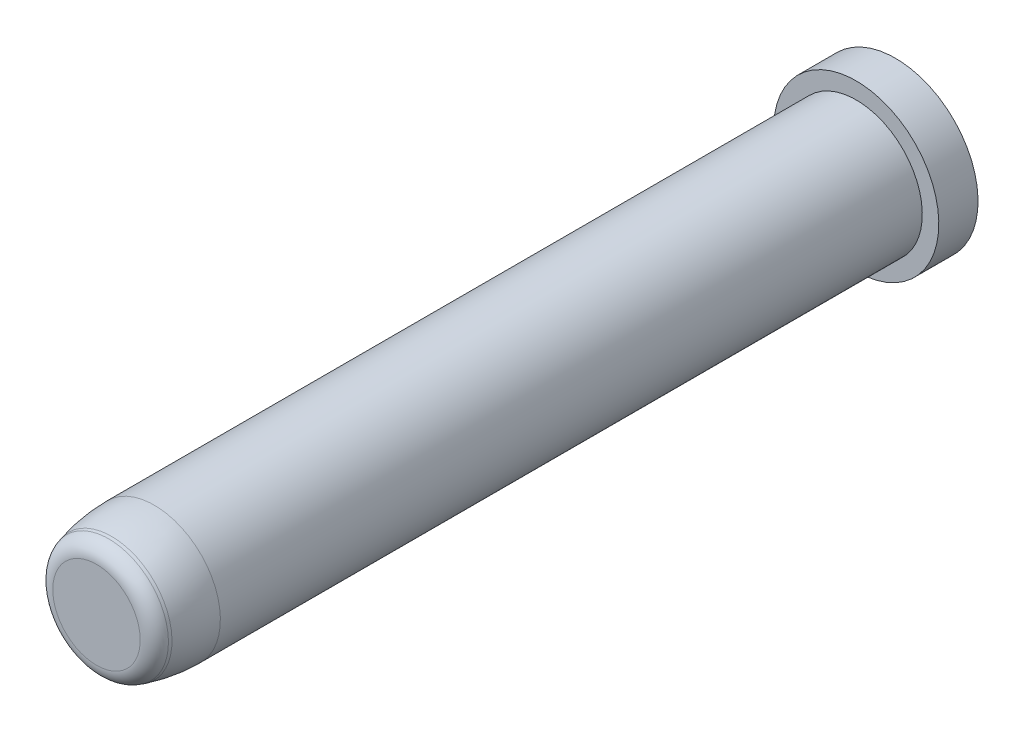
ISO-10303-21;
HEADER;
FILE_DESCRIPTION(('STEP AP214'),'2;1');
FILE_NAME('part.step','',(''),(''),'','','');
FILE_SCHEMA(('AUTOMOTIVE_DESIGN { 1 0 10303 214 1 1 1 1 }'));
ENDSEC;
DATA;
#1=APPLICATION_CONTEXT('core data for automotive mechanical design processes');
#2=APPLICATION_PROTOCOL_DEFINITION('international standard','automotive_design',2000,#1);
#3=PRODUCT_CONTEXT('',#1,'mechanical');
#4=PRODUCT('Part','Part','',(#3));
#5=PRODUCT_RELATED_PRODUCT_CATEGORY('part','',(#4));
#6=PRODUCT_DEFINITION_FORMATION('','',#4);
#7=PRODUCT_DEFINITION_CONTEXT('part definition',#1,'design');
#8=PRODUCT_DEFINITION('design','',#6,#7);
#9=PRODUCT_DEFINITION_SHAPE('','',#8);
#10=(LENGTH_UNIT() NAMED_UNIT(*) SI_UNIT(.MILLI.,.METRE.));
#11=(NAMED_UNIT(*) PLANE_ANGLE_UNIT() SI_UNIT($,.RADIAN.));
#12=(NAMED_UNIT(*) SI_UNIT($,.STERADIAN.) SOLID_ANGLE_UNIT());
#13=UNCERTAINTY_MEASURE_WITH_UNIT(LENGTH_MEASURE(1.E-05),#10,'distance_accuracy_value','');
#14=(GEOMETRIC_REPRESENTATION_CONTEXT(3) GLOBAL_UNCERTAINTY_ASSIGNED_CONTEXT((#13)) GLOBAL_UNIT_ASSIGNED_CONTEXT((#10,
#11,#12)) REPRESENTATION_CONTEXT('',''));
#15=CARTESIAN_POINT('',(0.,0.,0.));
#16=DIRECTION('',(0.,0.,1.));
#17=DIRECTION('',(1.,0.,0.));
#18=AXIS2_PLACEMENT_3D('',#15,#16,#17);
#19=CARTESIAN_POINT('',(-1.15218884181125E-13,0.,92.));
#20=DIRECTION('',(0.,0.,1.));
#21=DIRECTION('',(0.,-1.,0.));
#22=AXIS2_PLACEMENT_3D('',#19,#20,#21);
#23=PLANE('',#22);
#24=CARTESIAN_POINT('',(-1.15218884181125E-13,0.,92.));
#25=DIRECTION('',(0.,0.,1.));
#26=DIRECTION('',(0.,-1.,0.));
#27=AXIS2_PLACEMENT_3D('',#24,#25,#26);
#28=CIRCLE('',#27,5.29522528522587);
#29=CARTESIAN_POINT('',(-1.15218884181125E-13,-5.29522528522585,92.));
#30=VERTEX_POINT('',#29);
#31=EDGE_CURVE('E11',#30,#30,#28,.T.);
#32=ORIENTED_EDGE('',*,*,#31,.T.);
#33=EDGE_LOOP('',(#32));
#34=FACE_BOUND('',#33,.T.);
#35=ADVANCED_FACE('F34',(#34),#23,.T.);
#36=CARTESIAN_POINT('',(-1.15218884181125E-13,0.,90.));
#37=DIRECTION('',(0.,0.,1.));
#38=DIRECTION('',(0.,-1.,0.));
#39=AXIS2_PLACEMENT_3D('',#36,#37,#38);
#40=TOROIDAL_SURFACE('',#39,5.29522528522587,2.);
#41=CARTESIAN_POINT('',(-1.15218884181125E-13,0.,90.517638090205));
#42=DIRECTION('',(0.,0.,1.));
#43=DIRECTION('',(0.,-1.,0.));
#44=AXIS2_PLACEMENT_3D('',#41,#42,#43);
#45=CIRCLE('',#44,7.22707693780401);
#46=CARTESIAN_POINT('',(-1.15218884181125E-13,-7.22707693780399,90.517638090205));
#47=VERTEX_POINT('',#46);
#48=EDGE_CURVE('E40',#47,#47,#45,.T.);
#49=ORIENTED_EDGE('',*,*,#48,.T.);
#50=EDGE_LOOP('',(#49));
#51=FACE_BOUND('',#50,.T.);
#52=ORIENTED_EDGE('',*,*,#31,.F.);
#53=EDGE_LOOP('',(#52));
#54=FACE_BOUND('',#53,.T.);
#55=ADVANCED_FACE('F68',(#51,#54),#40,.T.);
#56=CARTESIAN_POINT('',(-1.15218884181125E-13,0.,90.517638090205));
#57=DIRECTION('',(0.,0.,-1.));
#58=DIRECTION('',(0.,1.,0.));
#59=AXIS2_PLACEMENT_3D('',#56,#57,#58);
#60=CONICAL_SURFACE('',#59,7.22707693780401,0.261799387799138);
#61=CARTESIAN_POINT('',(-1.15218884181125E-13,0.,90.1763809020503));
#62=DIRECTION('',(0.,0.,1.));
#63=DIRECTION('',(0.,-1.,0.));
#64=AXIS2_PLACEMENT_3D('',#61,#62,#63);
#65=CIRCLE('',#64,7.31851652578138);
#66=CARTESIAN_POINT('',(-1.15218884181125E-13,-7.31851652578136,90.1763809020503));
#67=VERTEX_POINT('',#66);
#68=EDGE_CURVE('E63',#67,#67,#65,.T.);
#69=ORIENTED_EDGE('',*,*,#68,.T.);
#70=EDGE_LOOP('',(#69));
#71=FACE_BOUND('',#70,.T.);
#72=ORIENTED_EDGE('',*,*,#48,.F.);
#73=EDGE_LOOP('',(#72));
#74=FACE_BOUND('',#73,.T.);
#75=ADVANCED_FACE('F71',(#71,#74),#60,.T.);
#76=CARTESIAN_POINT('',(-1.15218884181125E-13,0.,85.));
#77=DIRECTION('',(0.,0.,1.));
#78=DIRECTION('',(0.,-1.,0.));
#79=AXIS2_PLACEMENT_3D('',#76,#77,#78);
#80=DEGENERATE_TOROIDAL_SURFACE('',#79,12.,20.,.F.);
#81=CARTESIAN_POINT('',(-1.15218884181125E-13,0.,85.));
#82=DIRECTION('',(0.,0.,1.));
#83=DIRECTION('',(0.,-1.,0.));
#84=AXIS2_PLACEMENT_3D('',#81,#82,#83);
#85=CIRCLE('',#84,7.99999999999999);
#86=CARTESIAN_POINT('',(-1.15218884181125E-13,-7.99999999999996,85.));
#87=VERTEX_POINT('',#86);
#88=EDGE_CURVE('E60',#87,#87,#85,.T.);
#89=ORIENTED_EDGE('',*,*,#88,.T.);
#90=EDGE_LOOP('',(#89));
#91=FACE_BOUND('',#90,.T.);
#92=ORIENTED_EDGE('',*,*,#68,.F.);
#93=EDGE_LOOP('',(#92));
#94=FACE_BOUND('',#93,.T.);
#95=ADVANCED_FACE('F73',(#91,#94),#80,.F.);
#96=CARTESIAN_POINT('',(-1.15218884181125E-13,0.,-8.));
#97=DIRECTION('',(0.,0.,1.));
#98=DIRECTION('',(0.,-1.,0.));
#99=AXIS2_PLACEMENT_3D('',#96,#97,#98);
#100=CYLINDRICAL_SURFACE('',#99,7.99999999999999);
#101=CARTESIAN_POINT('',(-1.15218884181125E-13,0.,0.));
#102=DIRECTION('',(0.,0.,1.));
#103=DIRECTION('',(0.,-1.,0.));
#104=AXIS2_PLACEMENT_3D('',#101,#102,#103);
#105=CIRCLE('',#104,8.);
#106=CARTESIAN_POINT('',(-1.15218884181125E-13,-8.,0.));
#107=VERTEX_POINT('',#106);
#108=EDGE_CURVE('E55',#107,#107,#105,.T.);
#109=ORIENTED_EDGE('',*,*,#108,.T.);
#110=EDGE_LOOP('',(#109));
#111=FACE_BOUND('',#110,.T.);
#112=ORIENTED_EDGE('',*,*,#88,.F.);
#113=EDGE_LOOP('',(#112));
#114=FACE_BOUND('',#113,.T.);
#115=ADVANCED_FACE('F80',(#111,#114),#100,.T.);
#116=CARTESIAN_POINT('',(-1.15218884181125E-13,8.,0.));
#117=DIRECTION('',(0.,0.,1.));
#118=DIRECTION('',(0.,-1.,0.));
#119=AXIS2_PLACEMENT_3D('',#116,#117,#118);
#120=PLANE('',#119);
#121=CARTESIAN_POINT('',(-1.15218884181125E-13,0.,0.));
#122=DIRECTION('',(0.,0.,1.));
#123=DIRECTION('',(0.,-1.,0.));
#124=AXIS2_PLACEMENT_3D('',#121,#122,#123);
#125=CIRCLE('',#124,10.);
#126=CARTESIAN_POINT('',(-1.15218884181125E-13,-10.,0.));
#127=VERTEX_POINT('',#126);
#128=EDGE_CURVE('E52',#127,#127,#125,.T.);
#129=ORIENTED_EDGE('',*,*,#128,.T.);
#130=EDGE_LOOP('',(#129));
#131=FACE_BOUND('',#130,.T.);
#132=ORIENTED_EDGE('',*,*,#108,.F.);
#133=EDGE_LOOP('',(#132));
#134=FACE_BOUND('',#133,.T.);
#135=ADVANCED_FACE('F111',(#131,#134),#120,.T.);
#136=CARTESIAN_POINT('',(-1.15218884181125E-13,0.,-8.));
#137=DIRECTION('',(0.,0.,1.));
#138=DIRECTION('',(0.,-1.,0.));
#139=AXIS2_PLACEMENT_3D('',#136,#137,#138);
#140=CYLINDRICAL_SURFACE('',#139,10.);
#141=CARTESIAN_POINT('',(-1.15218884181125E-13,0.,-4.75080303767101));
#142=DIRECTION('',(0.,0.,1.));
#143=DIRECTION('',(0.,-1.,0.));
#144=AXIS2_PLACEMENT_3D('',#141,#142,#143);
#145=CIRCLE('',#144,10.);
#146=CARTESIAN_POINT('',(-1.15218884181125E-13,-10.,-4.750803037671));
#147=VERTEX_POINT('',#146);
#148=EDGE_CURVE('E50',#147,#147,#145,.T.);
#149=ORIENTED_EDGE('',*,*,#148,.T.);
#150=EDGE_LOOP('',(#149));
#151=FACE_BOUND('',#150,.T.);
#152=ORIENTED_EDGE('',*,*,#128,.F.);
#153=EDGE_LOOP('',(#152));
#154=FACE_BOUND('',#153,.T.);
#155=ADVANCED_FACE('F46',(#151,#154),#140,.T.);
#156=CARTESIAN_POINT('',(-1.15218884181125E-13,0.,-4.75080303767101));
#157=DIRECTION('',(0.,0.,1.));
#158=DIRECTION('',(0.,-1.,0.));
#159=AXIS2_PLACEMENT_3D('',#156,#157,#158);
#160=CONICAL_SURFACE('',#159,10.,1.25663706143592);
#161=CARTESIAN_POINT('',(-1.15218884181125E-13,0.,-8.));
#162=VERTEX_POINT('',#161);
#163=VERTEX_LOOP('',#162);
#164=FACE_BOUND('',#163,.T.);
#165=ORIENTED_EDGE('',*,*,#148,.F.);
#166=EDGE_LOOP('',(#165));
#167=FACE_BOUND('',#166,.T.);
#168=ADVANCED_FACE('F43',(#164,#167),#160,.T.);
#169=CLOSED_SHELL('',(#35,#55,#75,#95,#115,#135,#155,#168));
#170=MANIFOLD_SOLID_BREP('B2',#169);
#171=ADVANCED_BREP_SHAPE_REPRESENTATION('',(#18,#170),#14);
#172=SHAPE_DEFINITION_REPRESENTATION(#9,#171);
ENDSEC;
END-ISO-10303-21;
